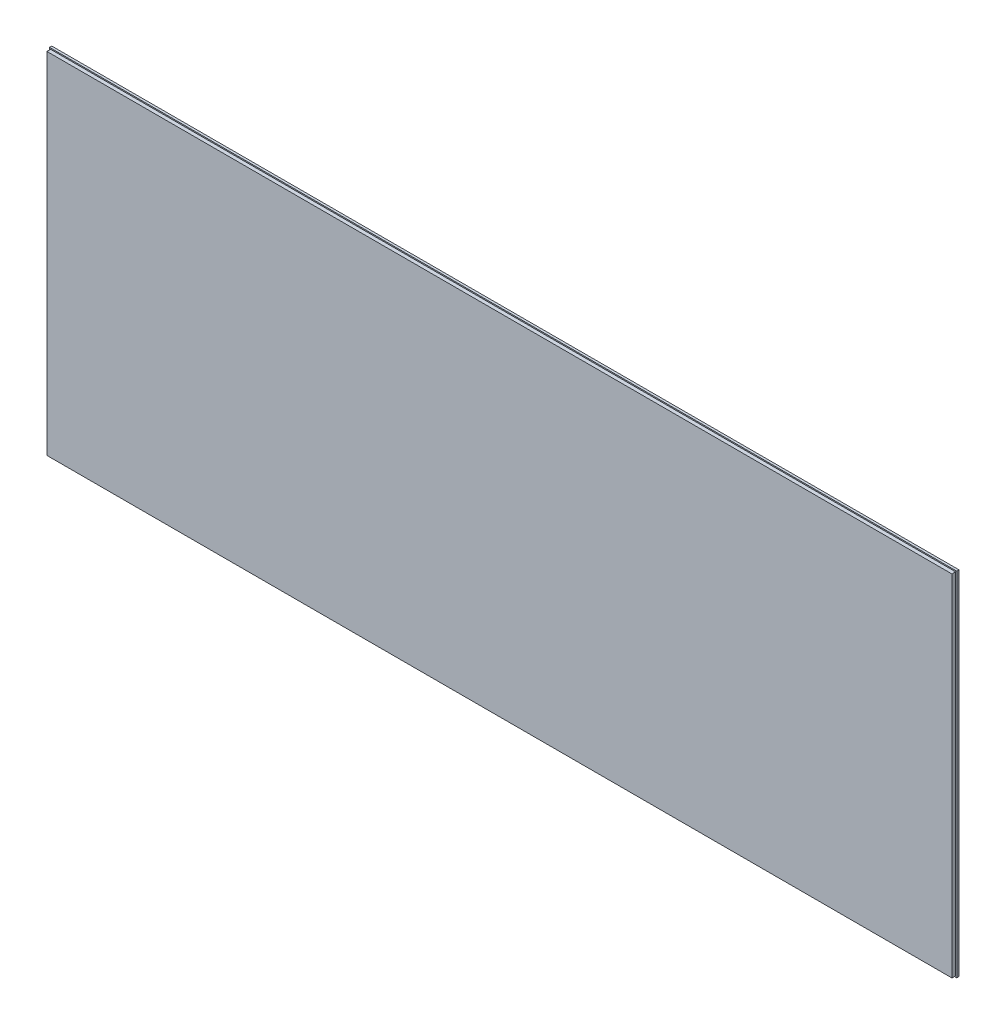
from build123d import *

# Parameters (mm, degrees)
SKIZZE1_W                       = 1976
SKIZZE1_H                       = 767
AUFSATZ_LINEAR_AUSTRAGEN1_DEPTH = 13
SKIZZE6_W                       = 8
SKIZZE6_H                       = 2.5
SCHNITT_LINEAR_AUSTRAGEN1_DEPTH = 2013.912628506
SKIZZE7_W                       = 2.5
SKIZZE7_H                       = 8
SCHNITT_LINEAR_AUSTRAGEN2_DEPTH = 1250.309109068


with BuildPart() as part:
    # Skizze1 → Aufsatz-Linear austragen1 (new body)
    with BuildSketch(Plane.XY):
        Rectangle(SKIZZE1_W, SKIZZE1_H)
    extrude(amount=AUFSATZ_LINEAR_AUSTRAGEN1_DEPTH)

    # Skizze6 → Schnitt-Linear austragen1 (cut, through all)
    with BuildSketch(Plane.ZY.offset(988)):
        with Locations((9, 382.25)):
            Rectangle(SKIZZE6_W, SKIZZE6_H)
    schnitt_linear_austragen1 = extrude(amount=-SCHNITT_LINEAR_AUSTRAGEN1_DEPTH, mode=Mode.SUBTRACT)

    # Spiegeln1: Schnitt-Linear austragen1 across plane
    add(schnitt_linear_austragen1.mirror(Plane.ZX), mode=Mode.SUBTRACT)

    # Skizze7 → Schnitt-Linear austragen2 (cut, through all)
    with BuildSketch(Plane.XZ.offset(381)):
        with Locations((-986.75, 9)):
            Rectangle(SKIZZE7_W, SKIZZE7_H)
    schnitt_linear_austragen2 = extrude(amount=-SCHNITT_LINEAR_AUSTRAGEN2_DEPTH, mode=Mode.SUBTRACT)

    # Spiegeln2: Schnitt-Linear austragen2 across plane
    add(schnitt_linear_austragen2.mirror(Plane(origin=(0, 0, 0), x_dir=(0, 0, 1), z_dir=(1, 0, 0))), mode=Mode.SUBTRACT)


solid = part.part
